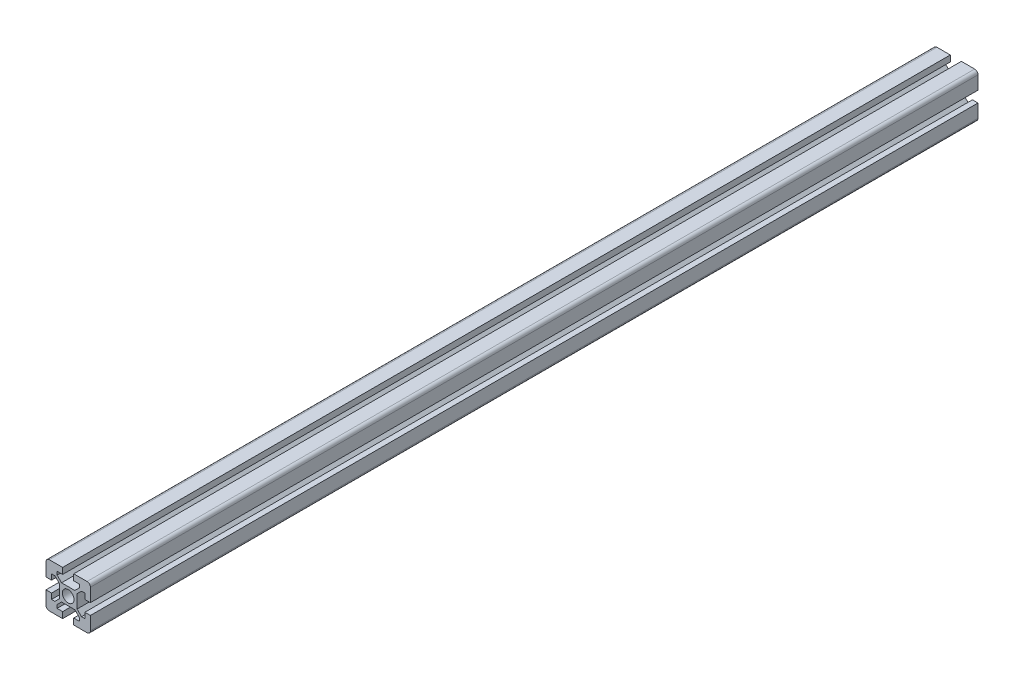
from build123d import *

# Parameters (mm, degrees)
SKETCH_1_R      = 5.25
EXTRUDE_1_DEPTH = 800


with BuildPart() as part:
    # Sketch 1 → Extrude 1 (new body)
    with BuildSketch(Plane.XY):
        with BuildLine():
            Line((10, -5.5), (15, -5.5))
            Line((15, -5.5), (15, 0))
            Line((15, 0), (3, 0))
            ThreePointArc((3, 0), (0.878679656, -0.878679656), (0, -3))
            Line((0, -3), (0, -15))
            Line((0, -15), (5, -15))
            Line((5, -15), (5, -10))
            Line((5, -10), (8, -10))
            Line((8, -10), (12, -14))
            Line((12, -14), (12, -26))
            Line((12, -26), (8, -30))
            Line((8, -30), (5, -30))
            Line((5, -30), (5, -25))
            Line((5, -25), (0, -25))
            Line((0, -25), (0, -37))
            ThreePointArc((0, -37), (0.878679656, -39.121320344), (3, -40))
            Line((3, -40), (15, -40))
            Line((15, -40), (15, -34.5))
            Line((15, -34.5), (10, -34.5))
            Line((10, -34.5), (10, -31.5))
            Line((10, -31.5), (14, -27.5))
            Line((14, -27.5), (26, -27.5))
            Line((26, -27.5), (30, -31.5))
            Line((30, -31.5), (30, -34.5))
            Line((30, -34.5), (25, -34.5))
            Line((25, -34.5), (25, -40))
            Line((25, -40), (37, -40))
            ThreePointArc((37, -40), (39.121320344, -39.121320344), (40, -37))
            Line((40, -37), (40, -25))
            Line((40, -25), (35, -25))
            Line((35, -25), (35, -30))
            Line((35, -30), (32, -30))
            Line((32, -30), (28, -26))
            Line((28, -26), (28, -14))
            Line((28, -14), (32, -10))
            Line((32, -10), (35, -10))
            Line((35, -10), (35, -15))
            Line((35, -15), (40, -15))
            Line((40, -15), (40, -3))
            ThreePointArc((40, -3), (39.121320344, -0.878679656), (37, 0))
            Line((37, 0), (25, 0))
            Line((25, 0), (25, -5.5))
            Line((25, -5.5), (30, -5.5))
            Line((30, -5.5), (30, -8.5))
            Line((30, -8.5), (26, -12.5))
            Line((26, -12.5), (14, -12.5))
            Line((14, -12.5), (10, -8.5))
            Line((10, -8.5), (10, -5.5))
        make_face()
        with Locations((20, -20)):
            Circle(SKETCH_1_R, mode=Mode.SUBTRACT)
    extrude(amount=EXTRUDE_1_DEPTH)


solid = part.part
